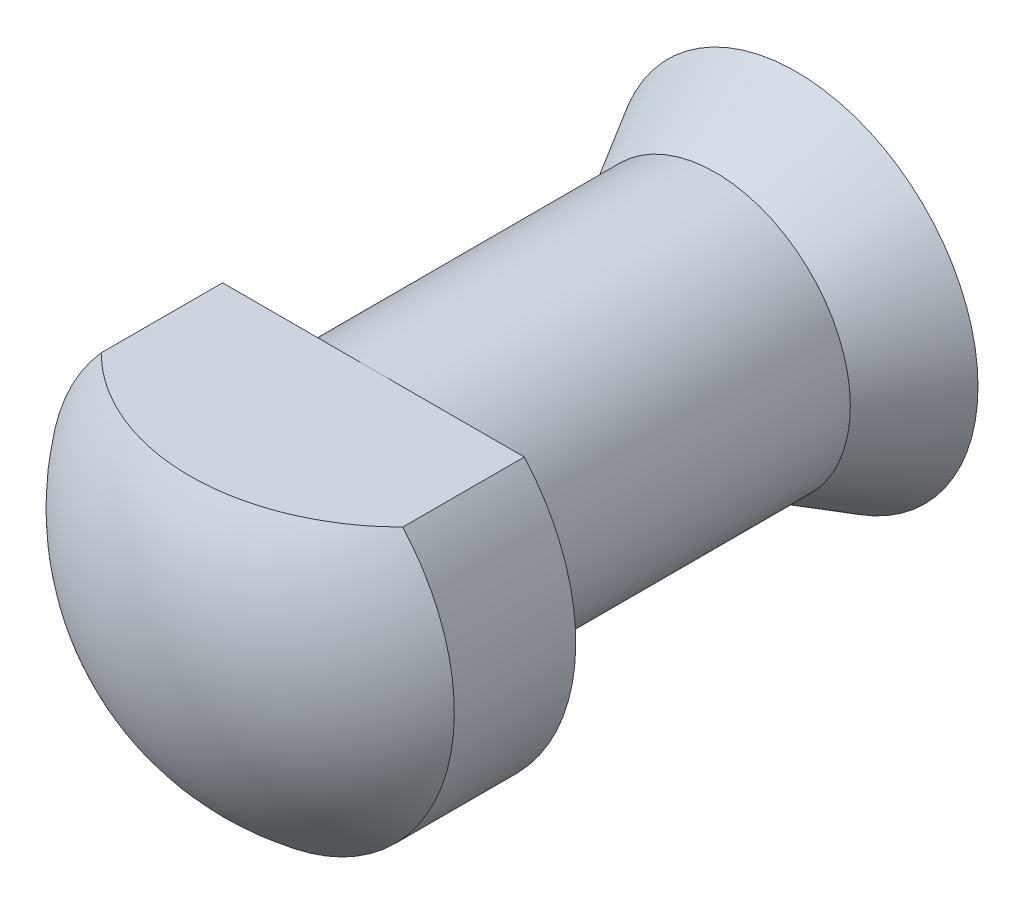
ISO-10303-21;
HEADER;
FILE_DESCRIPTION(('STEP AP214'),'2;1');
FILE_NAME('part.step','',(''),(''),'','','');
FILE_SCHEMA(('AUTOMOTIVE_DESIGN { 1 0 10303 214 1 1 1 1 }'));
ENDSEC;
DATA;
#1=APPLICATION_CONTEXT('core data for automotive mechanical design processes');
#2=APPLICATION_PROTOCOL_DEFINITION('international standard','automotive_design',2000,#1);
#3=PRODUCT_CONTEXT('',#1,'mechanical');
#4=PRODUCT('Part','Part','',(#3));
#5=PRODUCT_RELATED_PRODUCT_CATEGORY('part','',(#4));
#6=PRODUCT_DEFINITION_FORMATION('','',#4);
#7=PRODUCT_DEFINITION_CONTEXT('part definition',#1,'design');
#8=PRODUCT_DEFINITION('design','',#6,#7);
#9=PRODUCT_DEFINITION_SHAPE('','',#8);
#10=(LENGTH_UNIT() NAMED_UNIT(*) SI_UNIT(.MILLI.,.METRE.));
#11=(NAMED_UNIT(*) PLANE_ANGLE_UNIT() SI_UNIT($,.RADIAN.));
#12=(NAMED_UNIT(*) SI_UNIT($,.STERADIAN.) SOLID_ANGLE_UNIT());
#13=UNCERTAINTY_MEASURE_WITH_UNIT(LENGTH_MEASURE(1.E-05),#10,'distance_accuracy_value','');
#14=(GEOMETRIC_REPRESENTATION_CONTEXT(3) GLOBAL_UNCERTAINTY_ASSIGNED_CONTEXT((#13)) GLOBAL_UNIT_ASSIGNED_CONTEXT((#10,
#11,#12)) REPRESENTATION_CONTEXT('',''));
#15=CARTESIAN_POINT('',(0.,0.,0.));
#16=DIRECTION('',(0.,0.,1.));
#17=DIRECTION('',(1.,0.,0.));
#18=AXIS2_PLACEMENT_3D('',#15,#16,#17);
#19=CARTESIAN_POINT('',(0.,0.,-4.7625));
#20=DIRECTION('',(0.,0.,1.));
#21=DIRECTION('',(0.,1.,0.));
#22=AXIS2_PLACEMENT_3D('',#19,#20,#21);
#23=SPHERICAL_SURFACE('',#22,4.7625);
#24=CARTESIAN_POINT('',(0.,2.54,-4.7625));
#25=DIRECTION('',(0.,-1.,0.));
#26=DIRECTION('',(1.,0.,0.));
#27=AXIS2_PLACEMENT_3D('',#24,#25,#26);
#28=CIRCLE('',#27,4.02862336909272);
#29=CARTESIAN_POINT('',(-2.83980633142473,2.54,-1.905));
#30=VERTEX_POINT('',#29);
#31=CARTESIAN_POINT('',(2.83980633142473,2.54,-1.905));
#32=VERTEX_POINT('',#31);
#33=EDGE_CURVE('E56',#30,#32,#28,.F.);
#34=ORIENTED_EDGE('',*,*,#33,.F.);
#35=CARTESIAN_POINT('',(0.,0.,-1.905));
#36=DIRECTION('',(0.,0.,1.));
#37=DIRECTION('',(1.,0.,0.));
#38=AXIS2_PLACEMENT_3D('',#35,#36,#37);
#39=CIRCLE('',#38,3.81);
#40=EDGE_CURVE('E79',#30,#32,#39,.T.);
#41=ORIENTED_EDGE('',*,*,#40,.T.);
#42=EDGE_LOOP('',(#34,#41));
#43=FACE_BOUND('',#42,.T.);
#44=ADVANCED_FACE('F37',(#43),#23,.T.);
#45=CARTESIAN_POINT('',(0.,0.,-6.80348801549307));
#46=DIRECTION('',(0.,0.,1.));
#47=DIRECTION('',(0.,-1.,0.));
#48=AXIS2_PLACEMENT_3D('',#45,#46,#47);
#49=SPHERICAL_SURFACE('',#48,6.35);
#50=CARTESIAN_POINT('',(0.,0.,-12.1539));
#51=DIRECTION('',(0.,0.,1.));
#52=DIRECTION('',(1.,0.,0.));
#53=AXIS2_PLACEMENT_3D('',#50,#51,#52);
#54=CIRCLE('',#53,3.419881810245);
#55=CARTESIAN_POINT('',(3.419881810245,0.,-12.1539));
#56=VERTEX_POINT('',#55);
#57=EDGE_CURVE('E88',#56,#56,#54,.T.);
#58=ORIENTED_EDGE('',*,*,#57,.F.);
#59=EDGE_LOOP('',(#58));
#60=FACE_BOUND('',#59,.T.);
#61=ADVANCED_FACE('F92',(#60),#49,.T.);
#62=CARTESIAN_POINT('',(0.,0.,-10.6299));
#63=DIRECTION('',(0.,0.,-1.));
#64=DIRECTION('',(-1.,0.,0.));
#65=AXIS2_PLACEMENT_3D('',#62,#63,#64);
#66=CONICAL_SURFACE('',#65,2.54,0.523598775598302);
#67=ORIENTED_EDGE('',*,*,#57,.T.);
#68=EDGE_LOOP('',(#67));
#69=FACE_BOUND('',#68,.T.);
#70=CARTESIAN_POINT('',(0.,0.,-10.6299));
#71=DIRECTION('',(0.,0.,1.));
#72=DIRECTION('',(1.,0.,0.));
#73=AXIS2_PLACEMENT_3D('',#70,#71,#72);
#74=CIRCLE('',#73,2.54);
#75=CARTESIAN_POINT('',(2.54,0.,-10.6299));
#76=VERTEX_POINT('',#75);
#77=EDGE_CURVE('E81',#76,#76,#74,.T.);
#78=ORIENTED_EDGE('',*,*,#77,.F.);
#79=EDGE_LOOP('',(#78));
#80=FACE_BOUND('',#79,.T.);
#81=ADVANCED_FACE('F96',(#69,#80),#66,.T.);
#82=CARTESIAN_POINT('',(0.,0.,0.));
#83=DIRECTION('',(0.,0.,1.));
#84=DIRECTION('',(1.,0.,0.));
#85=AXIS2_PLACEMENT_3D('',#82,#83,#84);
#86=CYLINDRICAL_SURFACE('',#85,2.54);
#87=ORIENTED_EDGE('',*,*,#77,.T.);
#88=EDGE_LOOP('',(#87));
#89=FACE_BOUND('',#88,.T.);
#90=CARTESIAN_POINT('',(0.,0.,-4.191));
#91=DIRECTION('',(0.,0.,1.));
#92=DIRECTION('',(1.,0.,0.));
#93=AXIS2_PLACEMENT_3D('',#90,#91,#92);
#94=CIRCLE('',#93,2.54);
#95=CARTESIAN_POINT('',(0.,2.54,-4.191));
#96=VERTEX_POINT('',#95);
#97=EDGE_CURVE('E76',#96,#96,#94,.T.);
#98=ORIENTED_EDGE('',*,*,#97,.F.);
#99=EDGE_LOOP('',(#98));
#100=FACE_BOUND('',#99,.T.);
#101=ADVANCED_FACE('F101',(#89,#100),#86,.T.);
#102=CARTESIAN_POINT('',(0.,-3.81,-4.191));
#103=DIRECTION('',(0.,0.,-1.));
#104=DIRECTION('',(-1.,0.,0.));
#105=AXIS2_PLACEMENT_3D('',#102,#103,#104);
#106=PLANE('',#105);
#107=DIRECTION('',(-1.,0.,0.));
#108=VECTOR('',#107,1.);
#109=CARTESIAN_POINT('',(-3.81,2.54,-4.191));
#110=LINE('',#109,#108);
#111=CARTESIAN_POINT('',(2.83980633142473,2.54,-4.191));
#112=VERTEX_POINT('',#111);
#113=EDGE_CURVE('E65',#112,#96,#110,.T.);
#114=ORIENTED_EDGE('',*,*,#113,.F.);
#115=CARTESIAN_POINT('',(0.,0.,-4.191));
#116=DIRECTION('',(0.,0.,1.));
#117=DIRECTION('',(1.,0.,0.));
#118=AXIS2_PLACEMENT_3D('',#115,#116,#117);
#119=CIRCLE('',#118,3.81);
#120=CARTESIAN_POINT('',(-2.83980633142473,2.54,-4.191));
#121=VERTEX_POINT('',#120);
#122=EDGE_CURVE('E74',#121,#112,#119,.T.);
#123=ORIENTED_EDGE('',*,*,#122,.F.);
#124=EDGE_CURVE('E51',#96,#121,#110,.T.);
#125=ORIENTED_EDGE('',*,*,#124,.F.);
#126=ORIENTED_EDGE('',*,*,#97,.T.);
#127=EDGE_LOOP('',(#114,#123,#125,#126));
#128=FACE_BOUND('',#127,.T.);
#129=ADVANCED_FACE('F73',(#128),#106,.T.);
#130=CARTESIAN_POINT('',(0.,0.,0.));
#131=DIRECTION('',(0.,0.,1.));
#132=DIRECTION('',(1.,0.,0.));
#133=AXIS2_PLACEMENT_3D('',#130,#131,#132);
#134=CYLINDRICAL_SURFACE('',#133,3.81);
#135=DIRECTION('',(0.,0.,1.));
#136=VECTOR('',#135,1.);
#137=CARTESIAN_POINT('',(2.83980633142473,2.54,0.));
#138=LINE('',#137,#136);
#139=EDGE_CURVE('E11',#32,#112,#138,.F.);
#140=ORIENTED_EDGE('',*,*,#139,.F.);
#141=ORIENTED_EDGE('',*,*,#40,.F.);
#142=DIRECTION('',(0.,0.,1.));
#143=VECTOR('',#142,1.);
#144=CARTESIAN_POINT('',(-2.83980633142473,2.54,0.));
#145=LINE('',#144,#143);
#146=EDGE_CURVE('E44',#121,#30,#145,.T.);
#147=ORIENTED_EDGE('',*,*,#146,.F.);
#148=ORIENTED_EDGE('',*,*,#122,.T.);
#149=EDGE_LOOP('',(#140,#141,#147,#148));
#150=FACE_BOUND('',#149,.T.);
#151=ADVANCED_FACE('F78',(#150),#134,.T.);
#152=CARTESIAN_POINT('',(-3.81,2.54,0.));
#153=DIRECTION('',(0.,-1.,0.));
#154=DIRECTION('',(1.,0.,0.));
#155=AXIS2_PLACEMENT_3D('',#152,#153,#154);
#156=PLANE('',#155);
#157=ORIENTED_EDGE('',*,*,#139,.T.);
#158=ORIENTED_EDGE('',*,*,#113,.T.);
#159=ORIENTED_EDGE('',*,*,#124,.T.);
#160=ORIENTED_EDGE('',*,*,#146,.T.);
#161=ORIENTED_EDGE('',*,*,#33,.T.);
#162=EDGE_LOOP('',(#157,#158,#159,#160,#161));
#163=FACE_BOUND('',#162,.T.);
#164=ADVANCED_FACE('F64',(#163),#156,.F.);
#165=CLOSED_SHELL('',(#44,#61,#81,#101,#129,#151,#164));
#166=MANIFOLD_SOLID_BREP('B2',#165);
#167=ADVANCED_BREP_SHAPE_REPRESENTATION('',(#18,#166),#14);
#168=SHAPE_DEFINITION_REPRESENTATION(#9,#167);
ENDSEC;
END-ISO-10303-21;
